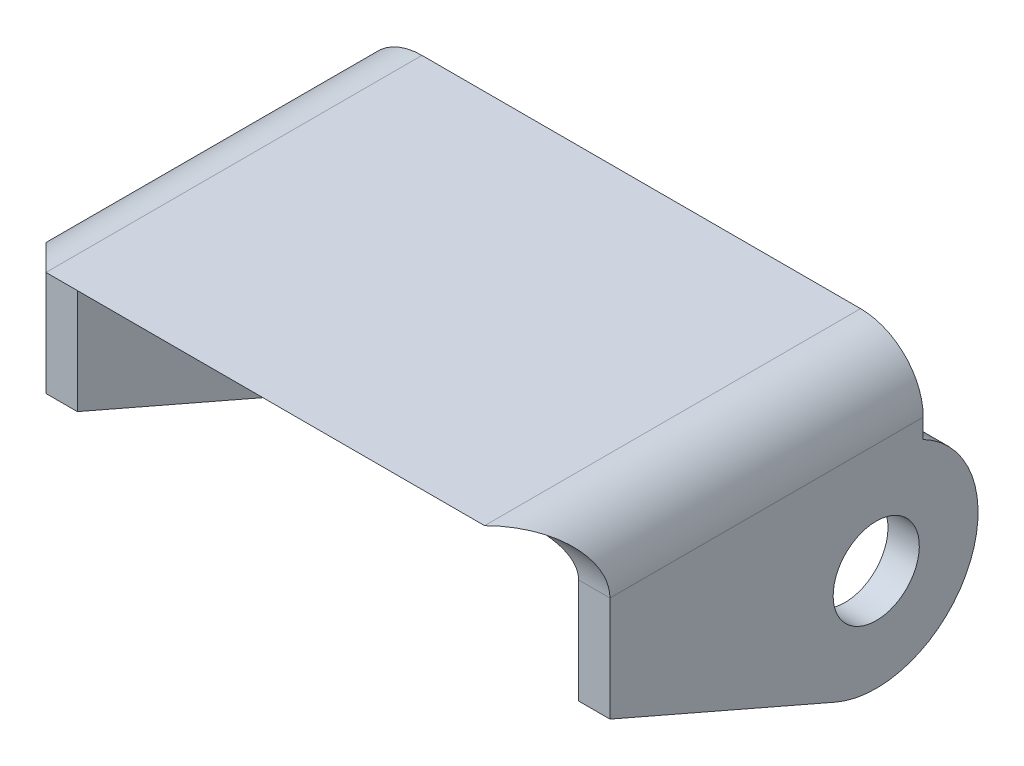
ISO-10303-21;
HEADER;
FILE_DESCRIPTION(('STEP AP214'),'2;1');
FILE_NAME('part.step','',(''),(''),'','','');
FILE_SCHEMA(('AUTOMOTIVE_DESIGN { 1 0 10303 214 1 1 1 1 }'));
ENDSEC;
DATA;
#1=APPLICATION_CONTEXT('core data for automotive mechanical design processes');
#2=APPLICATION_PROTOCOL_DEFINITION('international standard','automotive_design',2000,#1);
#3=PRODUCT_CONTEXT('',#1,'mechanical');
#4=PRODUCT('Part','Part','',(#3));
#5=PRODUCT_RELATED_PRODUCT_CATEGORY('part','',(#4));
#6=PRODUCT_DEFINITION_FORMATION('','',#4);
#7=PRODUCT_DEFINITION_CONTEXT('part definition',#1,'design');
#8=PRODUCT_DEFINITION('design','',#6,#7);
#9=PRODUCT_DEFINITION_SHAPE('','',#8);
#10=(LENGTH_UNIT() NAMED_UNIT(*) SI_UNIT(.MILLI.,.METRE.));
#11=(NAMED_UNIT(*) PLANE_ANGLE_UNIT() SI_UNIT($,.RADIAN.));
#12=(NAMED_UNIT(*) SI_UNIT($,.STERADIAN.) SOLID_ANGLE_UNIT());
#13=UNCERTAINTY_MEASURE_WITH_UNIT(LENGTH_MEASURE(1.E-05),#10,'distance_accuracy_value','');
#14=(GEOMETRIC_REPRESENTATION_CONTEXT(3) GLOBAL_UNCERTAINTY_ASSIGNED_CONTEXT((#13)) GLOBAL_UNIT_ASSIGNED_CONTEXT((#10,
#11,#12)) REPRESENTATION_CONTEXT('',''));
#15=CARTESIAN_POINT('',(0.,0.,0.));
#16=DIRECTION('',(0.,0.,1.));
#17=DIRECTION('',(1.,0.,0.));
#18=AXIS2_PLACEMENT_3D('',#15,#16,#17);
#19=CARTESIAN_POINT('',(-50.8000000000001,-12.7,88.9));
#20=DIRECTION('',(-1.,0.,0.));
#21=DIRECTION('',(0.,-1.,0.));
#22=AXIS2_PLACEMENT_3D('',#19,#20,#21);
#23=PLANE('',#22);
#24=CARTESIAN_POINT('',(-50.8000000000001,-34.9249999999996,22.225));
#25=DIRECTION('',(-1.,0.,0.));
#26=DIRECTION('',(0.,-1.,0.));
#27=AXIS2_PLACEMENT_3D('',#24,#25,#26);
#28=CIRCLE('',#27,8.73125000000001);
#29=CARTESIAN_POINT('',(-50.8000000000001,-43.6562499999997,22.225));
#30=VERTEX_POINT('',#29);
#31=EDGE_CURVE('E159',#30,#30,#28,.T.);
#32=ORIENTED_EDGE('',*,*,#31,.T.);
#33=EDGE_LOOP('',(#32));
#34=FACE_BOUND('',#33,.T.);
#35=DIRECTION('',(0.,-1.,0.));
#36=VECTOR('',#35,1.);
#37=CARTESIAN_POINT('',(-50.8000000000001,-12.7,12.7));
#38=LINE('',#37,#36);
#39=CARTESIAN_POINT('',(-50.8000000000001,-12.7,12.7));
#40=VERTEX_POINT('',#39);
#41=CARTESIAN_POINT('',(-50.8000000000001,-16.6170568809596,12.7000000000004));
#42=VERTEX_POINT('',#41);
#43=EDGE_CURVE('E201',#40,#42,#38,.T.);
#44=ORIENTED_EDGE('',*,*,#43,.F.);
#45=DIRECTION('',(0.,0.,-1.));
#46=VECTOR('',#45,1.);
#47=CARTESIAN_POINT('',(-50.8000000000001,-12.7,88.9));
#48=LINE('',#47,#46);
#49=CARTESIAN_POINT('',(-50.8000000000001,-12.7,76.2));
#50=VERTEX_POINT('',#49);
#51=EDGE_CURVE('E180',#50,#40,#48,.T.);
#52=ORIENTED_EDGE('',*,*,#51,.F.);
#53=DIRECTION('',(0.,1.,0.));
#54=VECTOR('',#53,1.);
#55=CARTESIAN_POINT('',(-50.8000000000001,-12.7,76.2));
#56=LINE('',#55,#54);
#57=CARTESIAN_POINT('',(-50.8000000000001,-33.9599803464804,76.2));
#58=VERTEX_POINT('',#57);
#59=EDGE_CURVE('E481',#58,#50,#56,.T.);
#60=ORIENTED_EDGE('',*,*,#59,.F.);
#61=DIRECTION('',(0.,0.39874906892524,0.917060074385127));
#62=VECTOR('',#61,1.);
#63=CARTESIAN_POINT('',(-50.8000000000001,-25.9355300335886,94.6549722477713));
#64=LINE('',#63,#62);
#65=CARTESIAN_POINT('',(-50.8000000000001,-53.8508272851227,30.4541839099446));
#66=VERTEX_POINT('',#65);
#67=EDGE_CURVE('E53',#66,#58,#64,.T.);
#68=ORIENTED_EDGE('',*,*,#67,.F.);
#69=CARTESIAN_POINT('',(-50.8000000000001,-34.9249999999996,22.225));
#70=DIRECTION('',(-1.,0.,0.));
#71=DIRECTION('',(0.,-1.,0.));
#72=AXIS2_PLACEMENT_3D('',#69,#70,#71);
#73=CIRCLE('',#72,20.6375);
#74=EDGE_CURVE('E48',#42,#66,#73,.T.);
#75=ORIENTED_EDGE('',*,*,#74,.F.);
#76=EDGE_LOOP('',(#44,#52,#60,#68,#75));
#77=FACE_BOUND('',#76,.T.);
#78=ADVANCED_FACE('F34',(#34,#77),#23,.F.);
#79=CARTESIAN_POINT('',(-44.4500000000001,-12.7,88.9));
#80=DIRECTION('',(0.,0.,-1.));
#81=DIRECTION('',(-1.,0.,0.));
#82=AXIS2_PLACEMENT_3D('',#79,#80,#81);
#83=CYLINDRICAL_SURFACE('',#82,6.34999999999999);
#84=CARTESIAN_POINT('',(-44.4500000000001,-12.7,12.7));
#85=DIRECTION('',(0.,0.,-1.));
#86=DIRECTION('',(0.,1.,0.));
#87=AXIS2_PLACEMENT_3D('',#84,#85,#86);
#88=CIRCLE('',#87,6.34999999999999);
#89=CARTESIAN_POINT('',(-44.4500000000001,-6.35000000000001,12.7));
#90=VERTEX_POINT('',#89);
#91=EDGE_CURVE('E264',#90,#40,#88,.F.);
#92=ORIENTED_EDGE('',*,*,#91,.F.);
#93=DIRECTION('',(0.,0.,-1.));
#94=VECTOR('',#93,1.);
#95=CARTESIAN_POINT('',(-44.4500000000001,-6.35000000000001,88.9));
#96=LINE('',#95,#94);
#97=CARTESIAN_POINT('',(-44.4500000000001,-6.35000000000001,77.9014773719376));
#98=VERTEX_POINT('',#97);
#99=EDGE_CURVE('E177',#98,#90,#96,.T.);
#100=ORIENTED_EDGE('',*,*,#99,.F.);
#101=CARTESIAN_POINT('',(-50.8000000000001,-12.7,76.2));
#102=CARTESIAN_POINT('',(-50.8000284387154,-12.5323711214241,76.1999692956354));
#103=CARTESIAN_POINT('',(-50.793363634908,-12.3647572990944,76.203317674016));
#104=CARTESIAN_POINT('',(-50.7668612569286,-12.0308992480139,76.216546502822));
#105=CARTESIAN_POINT('',(-50.7470289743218,-11.8646544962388,76.2264243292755));
#106=CARTESIAN_POINT('',(-50.6945254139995,-11.5354920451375,76.2524266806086));
#107=CARTESIAN_POINT('',(-50.6619132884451,-11.3725626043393,76.2685224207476));
#108=CARTESIAN_POINT('',(-50.5842288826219,-11.0503963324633,76.3065449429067));
#109=CARTESIAN_POINT('',(-50.5391558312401,-10.8911597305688,76.3284720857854));
#110=CARTESIAN_POINT('',(-50.4370893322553,-10.5776441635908,76.3775904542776));
#111=CARTESIAN_POINT('',(-50.3801128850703,-10.4233584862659,76.4047741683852));
#112=CARTESIAN_POINT('',(-50.2547438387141,-10.1203942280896,76.4637825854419));
#113=CARTESIAN_POINT('',(-50.1863469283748,-9.97171779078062,76.495609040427));
#114=CARTESIAN_POINT('',(-49.9647771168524,-9.53517648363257,76.5970362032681));
#115=CARTESIAN_POINT('',(-49.7952247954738,-9.2567985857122,76.6725848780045));
#116=CARTESIAN_POINT('',(-49.4060622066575,-8.71528850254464,76.8377793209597));
#117=CARTESIAN_POINT('',(-49.1840620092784,-8.45406805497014,76.9279984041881));
#118=CARTESIAN_POINT('',(-48.7011608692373,-7.97064533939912,77.1105994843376));
#119=CARTESIAN_POINT('',(-48.4402286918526,-7.74847471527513,77.2029831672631));
#120=CARTESIAN_POINT('',(-48.0127157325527,-7.44036730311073,77.3397105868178));
#121=CARTESIAN_POINT('',(-47.857978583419,-7.33878924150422,77.3865961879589));
#122=CARTESIAN_POINT('',(-47.5394782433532,-7.14915069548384,77.4768185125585));
#123=CARTESIAN_POINT('',(-47.3757189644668,-7.06108441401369,77.520156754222));
#124=CARTESIAN_POINT('',(-47.0403229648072,-6.89936657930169,77.6017322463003));
#125=CARTESIAN_POINT('',(-46.8686981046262,-6.82569415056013,77.6399768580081));
#126=CARTESIAN_POINT('',(-46.5185388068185,-6.69345129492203,77.7099608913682));
#127=CARTESIAN_POINT('',(-46.3400091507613,-6.63487062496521,77.7417047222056));
#128=CARTESIAN_POINT('',(-46.0210443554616,-6.54575303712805,77.790672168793));
#129=CARTESIAN_POINT('',(-45.8817911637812,-6.51185997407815,77.8095515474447));
#130=CARTESIAN_POINT('',(-45.6007670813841,-6.45349516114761,77.8423197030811));
#131=CARTESIAN_POINT('',(-45.4589968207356,-6.42902108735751,77.8562097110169));
#132=CARTESIAN_POINT('',(-45.1731843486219,-6.38966147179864,77.8786491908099));
#133=CARTESIAN_POINT('',(-45.0291357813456,-6.37481087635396,77.8871791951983));
#134=CARTESIAN_POINT('',(-44.7400627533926,-6.35496836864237,77.8986093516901));
#135=CARTESIAN_POINT('',(-44.5950378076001,-6.34998178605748,77.9015064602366));
#136=CARTESIAN_POINT('',(-44.4500000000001,-6.35,77.9014773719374));
#137=B_SPLINE_CURVE_WITH_KNOTS('',3,(#101,#102,#103,#104,#105,#106,#107,#108,#109,#110,#111,
#112,#113,#114,#115,#116,#117,#118,#119,#120,#121,#122,#123,#124,#125,#126,#127,#128,#129,#130,
#131,#132,#133,#134,#135,#136),.UNSPECIFIED.,.F.,.F.,(4,2,2,2,2,2,2,2,2,2,2,2,2,2,2,2,2,4),(0.,
0.502697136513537,1.00519237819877,1.50538875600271,2.00561609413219,2.50513383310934,
3.00484056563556,4.00425076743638,5.0635194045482,6.12364249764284,6.69587604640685,
7.26786339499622,7.83901492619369,8.40977777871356,8.84306364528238,9.27624254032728,
9.7109857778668,10.1459638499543),.UNSPECIFIED.);
#138=EDGE_CURVE('E236',#50,#98,#137,.T.);
#139=ORIENTED_EDGE('',*,*,#138,.F.);
#140=ORIENTED_EDGE('',*,*,#51,.T.);
#141=EDGE_LOOP('',(#92,#100,#139,#140));
#142=FACE_BOUND('',#141,.T.);
#143=ADVANCED_FACE('F244',(#142),#83,.F.);
#144=CARTESIAN_POINT('',(44.4500000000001,-6.35000000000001,88.9));
#145=DIRECTION('',(0.,1.,0.));
#146=DIRECTION('',(0.,0.,1.));
#147=AXIS2_PLACEMENT_3D('',#144,#145,#146);
#148=PLANE('',#147);
#149=DIRECTION('',(-1.,0.,0.));
#150=VECTOR('',#149,1.);
#151=CARTESIAN_POINT('',(44.4500000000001,-6.35000000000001,12.7));
#152=LINE('',#151,#150);
#153=CARTESIAN_POINT('',(44.4500000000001,-6.35,12.7));
#154=VERTEX_POINT('',#153);
#155=EDGE_CURVE('E269',#154,#90,#152,.T.);
#156=ORIENTED_EDGE('',*,*,#155,.F.);
#157=DIRECTION('',(0.,0.,-1.));
#158=VECTOR('',#157,1.);
#159=CARTESIAN_POINT('',(44.4500000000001,-6.35,88.9));
#160=LINE('',#159,#158);
#161=CARTESIAN_POINT('',(44.4500000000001,-6.35,77.9014773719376));
#162=VERTEX_POINT('',#161);
#163=EDGE_CURVE('E174',#162,#154,#160,.T.);
#164=ORIENTED_EDGE('',*,*,#163,.F.);
#165=DIRECTION('',(-1.,0.,0.));
#166=VECTOR('',#165,1.);
#167=CARTESIAN_POINT('',(57.15,-6.35000000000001,77.9014773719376));
#168=LINE('',#167,#166);
#169=EDGE_CURVE('E223',#98,#162,#168,.F.);
#170=ORIENTED_EDGE('',*,*,#169,.F.);
#171=ORIENTED_EDGE('',*,*,#99,.T.);
#172=EDGE_LOOP('',(#156,#164,#170,#171));
#173=FACE_BOUND('',#172,.T.);
#174=ADVANCED_FACE('F247',(#173),#148,.F.);
#175=CARTESIAN_POINT('',(44.4500000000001,-12.7,88.9));
#176=DIRECTION('',(0.,0.,-1.));
#177=DIRECTION('',(-1.,0.,0.));
#178=AXIS2_PLACEMENT_3D('',#175,#176,#177);
#179=CYLINDRICAL_SURFACE('',#178,6.34999999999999);
#180=CARTESIAN_POINT('',(44.4500000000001,-12.7,12.7));
#181=DIRECTION('',(0.,0.,-1.));
#182=DIRECTION('',(0.,1.,0.));
#183=AXIS2_PLACEMENT_3D('',#180,#181,#182);
#184=CIRCLE('',#183,6.34999999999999);
#185=CARTESIAN_POINT('',(50.8000000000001,-12.7,12.7));
#186=VERTEX_POINT('',#185);
#187=EDGE_CURVE('E271',#186,#154,#184,.F.);
#188=ORIENTED_EDGE('',*,*,#187,.F.);
#189=DIRECTION('',(0.,0.,-1.));
#190=VECTOR('',#189,1.);
#191=CARTESIAN_POINT('',(50.8000000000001,-12.7,88.9));
#192=LINE('',#191,#190);
#193=CARTESIAN_POINT('',(50.8000000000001,-12.7,76.2));
#194=VERTEX_POINT('',#193);
#195=EDGE_CURVE('E171',#194,#186,#192,.T.);
#196=ORIENTED_EDGE('',*,*,#195,.F.);
#197=CARTESIAN_POINT('',(44.4500000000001,-6.35,77.9014773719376));
#198=CARTESIAN_POINT('',(44.6163044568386,-6.3499686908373,77.9015272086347));
#199=CARTESIAN_POINT('',(44.782585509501,-6.35653168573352,77.8977070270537));
#200=CARTESIAN_POINT('',(45.1136951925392,-6.38260638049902,77.8826977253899));
#201=CARTESIAN_POINT('',(45.2785246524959,-6.40211012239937,77.8715131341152));
#202=CARTESIAN_POINT('',(45.6045823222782,-6.45367657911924,77.8422306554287));
#203=CARTESIAN_POINT('',(45.7658258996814,-6.48566560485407,77.8241733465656));
#204=CARTESIAN_POINT('',(46.0845821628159,-6.56180055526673,77.781798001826));
#205=CARTESIAN_POINT('',(46.2420944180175,-6.60594787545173,77.7574792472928));
#206=CARTESIAN_POINT('',(46.5520315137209,-6.70580231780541,77.7034469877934));
#207=CARTESIAN_POINT('',(46.7044675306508,-6.76148178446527,77.6737464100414));
#208=CARTESIAN_POINT('',(47.0038526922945,-6.88394222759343,77.6098164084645));
#209=CARTESIAN_POINT('',(47.1507997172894,-6.95072743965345,77.5755852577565));
#210=CARTESIAN_POINT('',(47.5826519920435,-7.16713142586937,77.46744237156));
#211=CARTESIAN_POINT('',(47.858379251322,-7.33273696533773,77.3881161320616));
#212=CARTESIAN_POINT('',(48.4017108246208,-7.71739394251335,77.2161842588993));
#213=CARTESIAN_POINT('',(48.6668086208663,-7.93970771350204,77.1230231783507));
#214=CARTESIAN_POINT('',(49.1580033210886,-8.42493221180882,76.9383528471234));
#215=CARTESIAN_POINT('',(49.3840881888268,-8.68785542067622,76.8468441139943));
#216=CARTESIAN_POINT('',(49.6967113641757,-9.1182505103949,76.7145252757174));
#217=CARTESIAN_POINT('',(49.799228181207,-9.27320308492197,76.6699391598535));
#218=CARTESIAN_POINT('',(49.9907116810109,-9.59233367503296,76.5849841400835));
#219=CARTESIAN_POINT('',(50.0796841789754,-9.75650768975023,76.5446134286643));
#220=CARTESIAN_POINT('',(50.2431298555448,-10.0928779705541,76.4692880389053));
#221=CARTESIAN_POINT('',(50.3176187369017,-10.2650652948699,76.4343275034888));
#222=CARTESIAN_POINT('',(50.4513620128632,-10.6163844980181,76.3708189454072));
#223=CARTESIAN_POINT('',(50.5106203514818,-10.7955145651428,76.3422692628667));
#224=CARTESIAN_POINT('',(50.6010516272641,-11.1163563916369,76.2983425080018));
#225=CARTESIAN_POINT('',(50.6355522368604,-11.2569329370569,76.2814467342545));
#226=CARTESIAN_POINT('',(50.6949311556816,-11.54055238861,76.2522334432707));
#227=CARTESIAN_POINT('',(50.7198115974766,-11.6835947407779,76.2399149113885));
#228=CARTESIAN_POINT('',(50.7597795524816,-11.9717314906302,76.2200749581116));
#229=CARTESIAN_POINT('',(50.7748428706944,-12.1168300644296,76.2125653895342));
#230=CARTESIAN_POINT('',(50.794963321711,-12.4079493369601,76.2025180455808));
#231=CARTESIAN_POINT('',(50.8000163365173,-12.5539703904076,76.1999823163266));
#232=CARTESIAN_POINT('',(50.8000000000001,-12.7,76.2));
#233=B_SPLINE_CURVE_WITH_KNOTS('',3,(#197,#198,#199,#200,#201,#202,#203,#204,#205,#206,#207,
#208,#209,#210,#211,#212,#213,#214,#215,#216,#217,#218,#219,#220,#221,#222,#223,#224,#225,#226,
#227,#228,#229,#230,#231,#232),.UNSPECIFIED.,.F.,.F.,(4,2,2,2,2,2,2,2,2,2,2,2,2,2,2,2,2,4),(0.,
0.498703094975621,0.997099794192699,1.49259834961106,1.98815380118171,2.48253433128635,
2.97710384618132,3.96684223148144,5.03748734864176,6.10846219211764,6.68104886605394,
7.25338900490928,7.82510512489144,8.39667304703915,8.83348316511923,9.27019639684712,
9.70798190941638,10.1459474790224),.UNSPECIFIED.);
#234=EDGE_CURVE('E215',#162,#194,#233,.T.);
#235=ORIENTED_EDGE('',*,*,#234,.F.);
#236=ORIENTED_EDGE('',*,*,#163,.T.);
#237=EDGE_LOOP('',(#188,#196,#235,#236));
#238=FACE_BOUND('',#237,.T.);
#239=ADVANCED_FACE('F225',(#238),#179,.F.);
#240=CARTESIAN_POINT('',(50.8000000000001,-57.1500000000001,88.9));
#241=DIRECTION('',(1.,0.,0.));
#242=DIRECTION('',(0.,1.,0.));
#243=AXIS2_PLACEMENT_3D('',#240,#241,#242);
#244=PLANE('',#243);
#245=CARTESIAN_POINT('',(50.8000000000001,-34.925,22.225));
#246=DIRECTION('',(1.,0.,0.));
#247=DIRECTION('',(0.,1.,0.));
#248=AXIS2_PLACEMENT_3D('',#245,#246,#247);
#249=CIRCLE('',#248,8.73125000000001);
#250=CARTESIAN_POINT('',(50.8000000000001,-26.19375,22.225));
#251=VERTEX_POINT('',#250);
#252=EDGE_CURVE('E163',#251,#251,#249,.T.);
#253=ORIENTED_EDGE('',*,*,#252,.T.);
#254=EDGE_LOOP('',(#253));
#255=FACE_BOUND('',#254,.T.);
#256=DIRECTION('',(0.,1.,0.));
#257=VECTOR('',#256,1.);
#258=CARTESIAN_POINT('',(50.8000000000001,-57.1500000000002,12.7));
#259=LINE('',#258,#257);
#260=CARTESIAN_POINT('',(50.8000000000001,-16.6170568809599,12.7000000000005));
#261=VERTEX_POINT('',#260);
#262=EDGE_CURVE('E478',#261,#186,#259,.T.);
#263=ORIENTED_EDGE('',*,*,#262,.F.);
#264=CARTESIAN_POINT('',(50.8000000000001,-34.925,22.225));
#265=DIRECTION('',(1.,0.,0.));
#266=DIRECTION('',(0.,1.,0.));
#267=AXIS2_PLACEMENT_3D('',#264,#265,#266);
#268=CIRCLE('',#267,20.6375);
#269=CARTESIAN_POINT('',(50.8000000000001,-53.8508272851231,30.4541839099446));
#270=VERTEX_POINT('',#269);
#271=EDGE_CURVE('E467',#270,#261,#268,.T.);
#272=ORIENTED_EDGE('',*,*,#271,.F.);
#273=DIRECTION('',(0.,-0.39874906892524,-0.917060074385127));
#274=VECTOR('',#273,1.);
#275=CARTESIAN_POINT('',(50.8000000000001,-33.0031164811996,78.4006362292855));
#276=LINE('',#275,#274);
#277=CARTESIAN_POINT('',(50.8000000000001,-33.9599803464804,76.2));
#278=VERTEX_POINT('',#277);
#279=EDGE_CURVE('E472',#278,#270,#276,.T.);
#280=ORIENTED_EDGE('',*,*,#279,.F.);
#281=DIRECTION('',(0.,-1.,0.));
#282=VECTOR('',#281,1.);
#283=CARTESIAN_POINT('',(50.8000000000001,-57.1500000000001,76.2));
#284=LINE('',#283,#282);
#285=EDGE_CURVE('E242',#194,#278,#284,.T.);
#286=ORIENTED_EDGE('',*,*,#285,.F.);
#287=ORIENTED_EDGE('',*,*,#195,.T.);
#288=EDGE_LOOP('',(#263,#272,#280,#286,#287));
#289=FACE_BOUND('',#288,.T.);
#290=ADVANCED_FACE('F254',(#255,#289),#244,.F.);
#291=CARTESIAN_POINT('',(57.1500000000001,-12.7,88.9));
#292=DIRECTION('',(-1.,0.,0.));
#293=DIRECTION('',(0.,0.,1.));
#294=AXIS2_PLACEMENT_3D('',#291,#292,#293);
#295=PLANE('',#294);
#296=CARTESIAN_POINT('',(57.1499999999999,-34.9250000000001,22.225));
#297=DIRECTION('',(1.,0.,0.));
#298=DIRECTION('',(0.,1.,0.));
#299=AXIS2_PLACEMENT_3D('',#296,#297,#298);
#300=CIRCLE('',#299,8.73125000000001);
#301=CARTESIAN_POINT('',(57.15,-26.19375,22.225));
#302=VERTEX_POINT('',#301);
#303=EDGE_CURVE('E263',#302,#302,#300,.T.);
#304=ORIENTED_EDGE('',*,*,#303,.F.);
#305=EDGE_LOOP('',(#304));
#306=FACE_BOUND('',#305,.T.);
#307=DIRECTION('',(0.,-1.,0.));
#308=VECTOR('',#307,1.);
#309=CARTESIAN_POINT('',(57.1500000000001,0.,12.7));
#310=LINE('',#309,#308);
#311=CARTESIAN_POINT('',(57.1500000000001,-12.7,12.7));
#312=VERTEX_POINT('',#311);
#313=CARTESIAN_POINT('',(57.1500000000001,-16.6170568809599,12.7000000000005));
#314=VERTEX_POINT('',#313);
#315=EDGE_CURVE('E155',#312,#314,#310,.T.);
#316=ORIENTED_EDGE('',*,*,#315,.F.);
#317=DIRECTION('',(0.,0.,-1.));
#318=VECTOR('',#317,1.);
#319=CARTESIAN_POINT('',(57.1500000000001,-12.7,88.9));
#320=LINE('',#319,#318);
#321=CARTESIAN_POINT('',(57.1500000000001,-12.7,76.2));
#322=VERTEX_POINT('',#321);
#323=EDGE_CURVE('E168',#322,#312,#320,.T.);
#324=ORIENTED_EDGE('',*,*,#323,.F.);
#325=DIRECTION('',(0.,1.,0.));
#326=VECTOR('',#325,1.);
#327=CARTESIAN_POINT('',(57.1499999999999,-33.9599803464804,76.2));
#328=LINE('',#327,#326);
#329=CARTESIAN_POINT('',(57.1500000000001,-33.9599803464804,76.2));
#330=VERTEX_POINT('',#329);
#331=EDGE_CURVE('E447',#330,#322,#328,.T.);
#332=ORIENTED_EDGE('',*,*,#331,.F.);
#333=DIRECTION('',(0.,0.39874906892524,0.917060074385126));
#334=VECTOR('',#333,1.);
#335=CARTESIAN_POINT('',(57.1499999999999,-53.8508272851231,30.4541839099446));
#336=LINE('',#335,#334);
#337=CARTESIAN_POINT('',(57.1500000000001,-53.8508272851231,30.4541839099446));
#338=VERTEX_POINT('',#337);
#339=EDGE_CURVE('E203',#338,#330,#336,.T.);
#340=ORIENTED_EDGE('',*,*,#339,.F.);
#341=CARTESIAN_POINT('',(57.1499999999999,-34.9250000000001,22.225));
#342=DIRECTION('',(-1.,0.,0.));
#343=DIRECTION('',(0.,1.,0.));
#344=AXIS2_PLACEMENT_3D('',#341,#342,#343);
#345=CIRCLE('',#344,20.6375);
#346=EDGE_CURVE('E206',#314,#338,#345,.T.);
#347=ORIENTED_EDGE('',*,*,#346,.F.);
#348=EDGE_LOOP('',(#316,#324,#332,#340,#347));
#349=FACE_BOUND('',#348,.T.);
#350=ADVANCED_FACE('F308',(#306,#349),#295,.F.);
#351=CARTESIAN_POINT('',(44.4500000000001,-12.7,88.9));
#352=DIRECTION('',(0.,0.,-1.));
#353=DIRECTION('',(-1.,0.,0.));
#354=AXIS2_PLACEMENT_3D('',#351,#352,#353);
#355=CYLINDRICAL_SURFACE('',#354,12.7);
#356=CARTESIAN_POINT('',(44.4500000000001,-12.7,12.7));
#357=DIRECTION('',(0.,0.,-1.));
#358=DIRECTION('',(0.,1.,0.));
#359=AXIS2_PLACEMENT_3D('',#356,#357,#358);
#360=CIRCLE('',#359,12.7);
#361=CARTESIAN_POINT('',(44.4500000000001,0.,12.7));
#362=VERTEX_POINT('',#361);
#363=EDGE_CURVE('E461',#362,#312,#360,.T.);
#364=ORIENTED_EDGE('',*,*,#363,.F.);
#365=DIRECTION('',(0.,0.,-1.));
#366=VECTOR('',#365,1.);
#367=CARTESIAN_POINT('',(44.4500000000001,0.,88.9));
#368=LINE('',#367,#366);
#369=CARTESIAN_POINT('',(44.4500000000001,0.,88.9));
#370=VERTEX_POINT('',#369);
#371=EDGE_CURVE('E143',#370,#362,#368,.T.);
#372=ORIENTED_EDGE('',*,*,#371,.F.);
#373=CARTESIAN_POINT('',(44.4500000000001,-12.7,88.9));
#374=DIRECTION('',(-0.707106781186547,0.,-0.707106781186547));
#375=DIRECTION('',(0.707106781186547,0.,-0.707106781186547));
#376=AXIS2_PLACEMENT_3D('',#373,#374,#375);
#377=ELLIPSE('',#376,17.9605122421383,12.7);
#378=EDGE_CURVE('E154',#322,#370,#377,.F.);
#379=ORIENTED_EDGE('',*,*,#378,.F.);
#380=ORIENTED_EDGE('',*,*,#323,.T.);
#381=EDGE_LOOP('',(#364,#372,#379,#380));
#382=FACE_BOUND('',#381,.T.);
#383=ADVANCED_FACE('F305',(#382),#355,.T.);
#384=CARTESIAN_POINT('',(-44.4500000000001,0.,88.9));
#385=DIRECTION('',(0.,-1.,0.));
#386=DIRECTION('',(0.,0.,-1.));
#387=AXIS2_PLACEMENT_3D('',#384,#385,#386);
#388=PLANE('',#387);
#389=DIRECTION('',(-1.,0.,0.));
#390=VECTOR('',#389,1.);
#391=CARTESIAN_POINT('',(57.1500000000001,0.,12.7));
#392=LINE('',#391,#390);
#393=CARTESIAN_POINT('',(-44.4500000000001,0.,12.7));
#394=VERTEX_POINT('',#393);
#395=EDGE_CURVE('E140',#362,#394,#392,.T.);
#396=ORIENTED_EDGE('',*,*,#395,.T.);
#397=DIRECTION('',(0.,0.,-1.));
#398=VECTOR('',#397,1.);
#399=CARTESIAN_POINT('',(-44.4500000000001,0.,88.9));
#400=LINE('',#399,#398);
#401=CARTESIAN_POINT('',(-44.4500000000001,3.39014530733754E-13,88.9));
#402=VERTEX_POINT('',#401);
#403=EDGE_CURVE('E132',#402,#394,#400,.T.);
#404=ORIENTED_EDGE('',*,*,#403,.F.);
#405=DIRECTION('',(-1.,0.,0.));
#406=VECTOR('',#405,1.);
#407=CARTESIAN_POINT('',(-44.4500000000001,0.,88.9));
#408=LINE('',#407,#406);
#409=EDGE_CURVE('E137',#370,#402,#408,.T.);
#410=ORIENTED_EDGE('',*,*,#409,.F.);
#411=ORIENTED_EDGE('',*,*,#371,.T.);
#412=EDGE_LOOP('',(#396,#404,#410,#411));
#413=FACE_BOUND('',#412,.T.);
#414=ADVANCED_FACE('F134',(#413),#388,.F.);
#415=CARTESIAN_POINT('',(-44.4500000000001,-12.7,88.9));
#416=DIRECTION('',(0.,0.,-1.));
#417=DIRECTION('',(-1.,0.,0.));
#418=AXIS2_PLACEMENT_3D('',#415,#416,#417);
#419=CYLINDRICAL_SURFACE('',#418,12.7);
#420=CARTESIAN_POINT('',(-44.4500000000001,-12.7,12.7));
#421=DIRECTION('',(0.,0.,-1.));
#422=DIRECTION('',(0.,1.,0.));
#423=AXIS2_PLACEMENT_3D('',#420,#421,#422);
#424=CIRCLE('',#423,12.7);
#425=CARTESIAN_POINT('',(-57.1500000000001,-12.7,12.7));
#426=VERTEX_POINT('',#425);
#427=EDGE_CURVE('E470',#426,#394,#424,.T.);
#428=ORIENTED_EDGE('',*,*,#427,.F.);
#429=DIRECTION('',(0.,0.,-1.));
#430=VECTOR('',#429,1.);
#431=CARTESIAN_POINT('',(-57.1500000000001,-12.7,88.9));
#432=LINE('',#431,#430);
#433=CARTESIAN_POINT('',(-57.1500000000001,-12.7,76.2));
#434=VERTEX_POINT('',#433);
#435=EDGE_CURVE('E144',#434,#426,#432,.T.);
#436=ORIENTED_EDGE('',*,*,#435,.F.);
#437=CARTESIAN_POINT('',(-44.4500000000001,-12.6999999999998,88.9));
#438=DIRECTION('',(0.707106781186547,0.,-0.707106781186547));
#439=DIRECTION('',(-0.707106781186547,0.,-0.707106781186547));
#440=AXIS2_PLACEMENT_3D('',#437,#438,#439);
#441=ELLIPSE('',#440,17.9605122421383,12.7);
#442=EDGE_CURVE('E148',#402,#434,#441,.F.);
#443=ORIENTED_EDGE('',*,*,#442,.F.);
#444=ORIENTED_EDGE('',*,*,#403,.T.);
#445=EDGE_LOOP('',(#428,#436,#443,#444));
#446=FACE_BOUND('',#445,.T.);
#447=ADVANCED_FACE('F149',(#446),#419,.T.);
#448=CARTESIAN_POINT('',(-57.1500000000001,-57.1500000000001,88.9));
#449=DIRECTION('',(1.,0.,0.));
#450=DIRECTION('',(0.,0.,-1.));
#451=AXIS2_PLACEMENT_3D('',#448,#449,#450);
#452=PLANE('',#451);
#453=CARTESIAN_POINT('',(-57.1500000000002,-34.9249999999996,22.225));
#454=DIRECTION('',(1.,0.,0.));
#455=DIRECTION('',(0.,1.,0.));
#456=AXIS2_PLACEMENT_3D('',#453,#454,#455);
#457=CIRCLE('',#456,8.73125000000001);
#458=CARTESIAN_POINT('',(-57.1500000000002,-26.1937499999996,22.225));
#459=VERTEX_POINT('',#458);
#460=EDGE_CURVE('E275',#459,#459,#457,.T.);
#461=ORIENTED_EDGE('',*,*,#460,.T.);
#462=EDGE_LOOP('',(#461));
#463=FACE_BOUND('',#462,.T.);
#464=DIRECTION('',(0.,1.,0.));
#465=VECTOR('',#464,1.);
#466=CARTESIAN_POINT('',(-57.1500000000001,-57.1500000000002,12.7));
#467=LINE('',#466,#465);
#468=CARTESIAN_POINT('',(-57.1500000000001,-16.6170568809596,12.7000000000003));
#469=VERTEX_POINT('',#468);
#470=EDGE_CURVE('E11',#469,#426,#467,.T.);
#471=ORIENTED_EDGE('',*,*,#470,.F.);
#472=CARTESIAN_POINT('',(-57.1500000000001,-34.9249999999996,22.225));
#473=DIRECTION('',(1.,0.,0.));
#474=DIRECTION('',(0.,0.,-1.));
#475=AXIS2_PLACEMENT_3D('',#472,#473,#474);
#476=CIRCLE('',#475,20.6375);
#477=CARTESIAN_POINT('',(-57.1500000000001,-53.8508272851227,30.4541839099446));
#478=VERTEX_POINT('',#477);
#479=EDGE_CURVE('E41',#478,#469,#476,.T.);
#480=ORIENTED_EDGE('',*,*,#479,.F.);
#481=DIRECTION('',(0.,-0.39874906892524,-0.917060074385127));
#482=VECTOR('',#481,1.);
#483=CARTESIAN_POINT('',(-57.1500000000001,-33.0031164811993,78.4006362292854));
#484=LINE('',#483,#482);
#485=CARTESIAN_POINT('',(-57.1500000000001,-33.9599803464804,76.2));
#486=VERTEX_POINT('',#485);
#487=EDGE_CURVE('E186',#486,#478,#484,.T.);
#488=ORIENTED_EDGE('',*,*,#487,.F.);
#489=DIRECTION('',(0.,-1.,0.));
#490=VECTOR('',#489,1.);
#491=CARTESIAN_POINT('',(-57.1500000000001,-57.1500000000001,76.2));
#492=LINE('',#491,#490);
#493=EDGE_CURVE('E183',#434,#486,#492,.T.);
#494=ORIENTED_EDGE('',*,*,#493,.F.);
#495=ORIENTED_EDGE('',*,*,#435,.T.);
#496=EDGE_LOOP('',(#471,#480,#488,#494,#495));
#497=FACE_BOUND('',#496,.T.);
#498=ADVANCED_FACE('F294',(#463,#497),#452,.F.);
#499=CARTESIAN_POINT('',(-57.1500000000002,-34.9249999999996,22.225));
#500=DIRECTION('',(1.,0.,0.));
#501=DIRECTION('',(0.,1.,0.));
#502=AXIS2_PLACEMENT_3D('',#499,#500,#501);
#503=CYLINDRICAL_SURFACE('',#502,8.73125000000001);
#504=ORIENTED_EDGE('',*,*,#460,.F.);
#505=EDGE_LOOP('',(#504));
#506=FACE_BOUND('',#505,.T.);
#507=ORIENTED_EDGE('',*,*,#31,.F.);
#508=EDGE_LOOP('',(#507));
#509=FACE_BOUND('',#508,.T.);
#510=ADVANCED_FACE('F286',(#506,#509),#503,.F.);
#511=ORIENTED_EDGE('',*,*,#303,.T.);
#512=EDGE_LOOP('',(#511));
#513=FACE_BOUND('',#512,.T.);
#514=ORIENTED_EDGE('',*,*,#252,.F.);
#515=EDGE_LOOP('',(#514));
#516=FACE_BOUND('',#515,.T.);
#517=ADVANCED_FACE('F284',(#513,#516),#503,.F.);
#518=CARTESIAN_POINT('',(57.1500000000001,0.,12.7));
#519=DIRECTION('',(0.,0.,-1.));
#520=DIRECTION('',(0.,1.,0.));
#521=AXIS2_PLACEMENT_3D('',#518,#519,#520);
#522=PLANE('',#521);
#523=ORIENTED_EDGE('',*,*,#91,.T.);
#524=ORIENTED_EDGE('',*,*,#43,.T.);
#525=DIRECTION('',(-1.,0.,0.));
#526=VECTOR('',#525,1.);
#527=CARTESIAN_POINT('',(57.15,-16.6170568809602,12.7));
#528=LINE('',#527,#526);
#529=EDGE_CURVE('E194',#42,#469,#528,.T.);
#530=ORIENTED_EDGE('',*,*,#529,.T.);
#531=ORIENTED_EDGE('',*,*,#470,.T.);
#532=ORIENTED_EDGE('',*,*,#427,.T.);
#533=ORIENTED_EDGE('',*,*,#395,.F.);
#534=ORIENTED_EDGE('',*,*,#363,.T.);
#535=ORIENTED_EDGE('',*,*,#315,.T.);
#536=EDGE_CURVE('E202',#314,#261,#528,.T.);
#537=ORIENTED_EDGE('',*,*,#536,.T.);
#538=ORIENTED_EDGE('',*,*,#262,.T.);
#539=ORIENTED_EDGE('',*,*,#187,.T.);
#540=ORIENTED_EDGE('',*,*,#155,.T.);
#541=EDGE_LOOP('',(#523,#524,#530,#531,#532,#533,#534,#535,#537,#538,#539,#540));
#542=FACE_BOUND('',#541,.T.);
#543=ADVANCED_FACE('F200',(#542),#522,.T.);
#544=CARTESIAN_POINT('',(57.1499999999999,-34.9250000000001,22.225));
#545=DIRECTION('',(-1.,0.,0.));
#546=DIRECTION('',(0.,-1.,0.));
#547=AXIS2_PLACEMENT_3D('',#544,#545,#546);
#548=CYLINDRICAL_SURFACE('',#547,20.6375);
#549=ORIENTED_EDGE('',*,*,#529,.F.);
#550=ORIENTED_EDGE('',*,*,#74,.T.);
#551=DIRECTION('',(-1.,0.,0.));
#552=VECTOR('',#551,1.);
#553=CARTESIAN_POINT('',(57.1499999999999,-53.8508272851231,30.4541839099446));
#554=LINE('',#553,#552);
#555=EDGE_CURVE('E196',#66,#478,#554,.T.);
#556=ORIENTED_EDGE('',*,*,#555,.T.);
#557=ORIENTED_EDGE('',*,*,#479,.T.);
#558=EDGE_LOOP('',(#549,#550,#556,#557));
#559=FACE_BOUND('',#558,.T.);
#560=ADVANCED_FACE('F193',(#559),#548,.T.);
#561=EDGE_CURVE('E208',#338,#270,#554,.T.);
#562=ORIENTED_EDGE('',*,*,#561,.T.);
#563=ORIENTED_EDGE('',*,*,#271,.T.);
#564=ORIENTED_EDGE('',*,*,#536,.F.);
#565=ORIENTED_EDGE('',*,*,#346,.T.);
#566=EDGE_LOOP('',(#562,#563,#564,#565));
#567=FACE_BOUND('',#566,.T.);
#568=ADVANCED_FACE('F390',(#567),#548,.T.);
#569=CARTESIAN_POINT('',(57.1499999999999,-53.8508272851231,30.4541839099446));
#570=DIRECTION('',(0.,-0.917060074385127,0.39874906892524));
#571=DIRECTION('',(0.,-0.39874906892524,-0.917060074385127));
#572=AXIS2_PLACEMENT_3D('',#569,#570,#571);
#573=PLANE('',#572);
#574=ORIENTED_EDGE('',*,*,#555,.F.);
#575=ORIENTED_EDGE('',*,*,#67,.T.);
#576=DIRECTION('',(-1.,0.,0.));
#577=VECTOR('',#576,1.);
#578=CARTESIAN_POINT('',(57.1499999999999,-33.9599803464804,76.2));
#579=LINE('',#578,#577);
#580=EDGE_CURVE('E448',#58,#486,#579,.T.);
#581=ORIENTED_EDGE('',*,*,#580,.T.);
#582=ORIENTED_EDGE('',*,*,#487,.T.);
#583=EDGE_LOOP('',(#574,#575,#581,#582));
#584=FACE_BOUND('',#583,.T.);
#585=ADVANCED_FACE('F397',(#584),#573,.T.);
#586=EDGE_CURVE('E452',#330,#278,#579,.T.);
#587=ORIENTED_EDGE('',*,*,#586,.T.);
#588=ORIENTED_EDGE('',*,*,#279,.T.);
#589=ORIENTED_EDGE('',*,*,#561,.F.);
#590=ORIENTED_EDGE('',*,*,#339,.T.);
#591=EDGE_LOOP('',(#587,#588,#589,#590));
#592=FACE_BOUND('',#591,.T.);
#593=ADVANCED_FACE('F405',(#592),#573,.T.);
#594=CARTESIAN_POINT('',(57.1499999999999,-33.9599803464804,76.2));
#595=DIRECTION('',(0.,0.,1.));
#596=DIRECTION('',(0.,-1.,0.));
#597=AXIS2_PLACEMENT_3D('',#594,#595,#596);
#598=PLANE('',#597);
#599=ORIENTED_EDGE('',*,*,#580,.F.);
#600=ORIENTED_EDGE('',*,*,#59,.T.);
#601=DIRECTION('',(-1.,0.,0.));
#602=VECTOR('',#601,1.);
#603=CARTESIAN_POINT('',(57.15,-12.7,76.2));
#604=LINE('',#603,#602);
#605=EDGE_CURVE('E449',#50,#434,#604,.T.);
#606=ORIENTED_EDGE('',*,*,#605,.T.);
#607=ORIENTED_EDGE('',*,*,#493,.T.);
#608=EDGE_LOOP('',(#599,#600,#606,#607));
#609=FACE_BOUND('',#608,.T.);
#610=ADVANCED_FACE('F233',(#609),#598,.T.);
#611=EDGE_CURVE('E444',#322,#194,#604,.T.);
#612=ORIENTED_EDGE('',*,*,#611,.T.);
#613=ORIENTED_EDGE('',*,*,#285,.T.);
#614=ORIENTED_EDGE('',*,*,#586,.F.);
#615=ORIENTED_EDGE('',*,*,#331,.T.);
#616=EDGE_LOOP('',(#612,#613,#614,#615));
#617=FACE_BOUND('',#616,.T.);
#618=ADVANCED_FACE('F232',(#617),#598,.T.);
#619=CARTESIAN_POINT('',(57.15,-12.7,88.9));
#620=DIRECTION('',(-1.,0.,0.));
#621=DIRECTION('',(0.,-1.,0.));
#622=AXIS2_PLACEMENT_3D('',#619,#620,#621);
#623=CYLINDRICAL_SURFACE('',#622,12.7);
#624=ORIENTED_EDGE('',*,*,#605,.F.);
#625=ORIENTED_EDGE('',*,*,#138,.T.);
#626=ORIENTED_EDGE('',*,*,#169,.T.);
#627=ORIENTED_EDGE('',*,*,#234,.T.);
#628=ORIENTED_EDGE('',*,*,#611,.F.);
#629=ORIENTED_EDGE('',*,*,#378,.T.);
#630=ORIENTED_EDGE('',*,*,#409,.T.);
#631=ORIENTED_EDGE('',*,*,#442,.T.);
#632=EDGE_LOOP('',(#624,#625,#626,#627,#628,#629,#630,#631));
#633=FACE_BOUND('',#632,.T.);
#634=ADVANCED_FACE('F157',(#633),#623,.F.);
#635=CLOSED_SHELL('',(#78,#143,#174,#239,#290,#350,#383,#414,#447,#498,#510,#517,#543,#560,#568,
#585,#593,#610,#618,#634));
#636=MANIFOLD_SOLID_BREP('B2',#635);
#637=ADVANCED_BREP_SHAPE_REPRESENTATION('',(#18,#636),#14);
#638=SHAPE_DEFINITION_REPRESENTATION(#9,#637);
ENDSEC;
END-ISO-10303-21;
